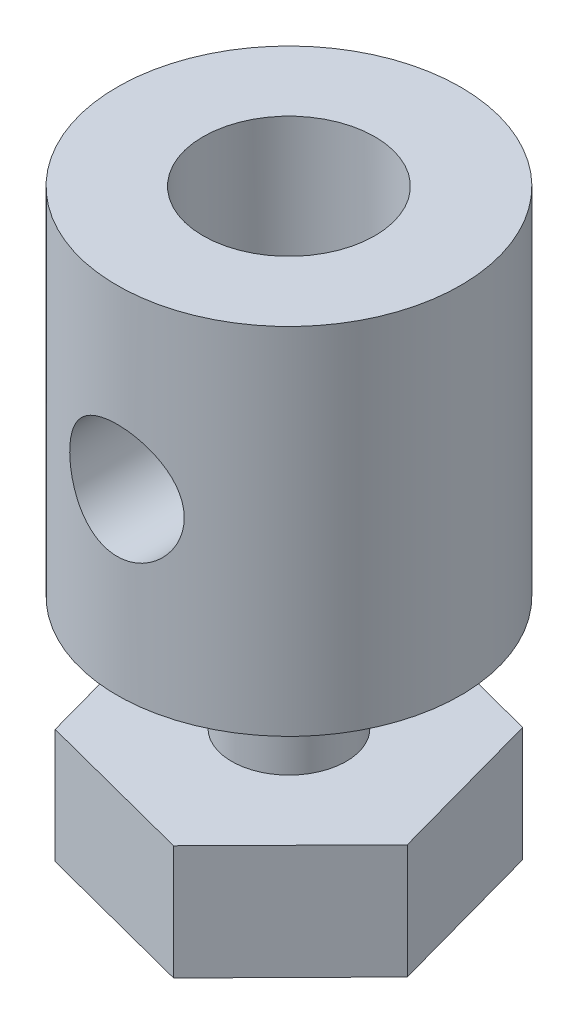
ISO-10303-21;
HEADER;
FILE_DESCRIPTION(('STEP AP214'),'2;1');
FILE_NAME('part.step','',(''),(''),'','','');
FILE_SCHEMA(('AUTOMOTIVE_DESIGN { 1 0 10303 214 1 1 1 1 }'));
ENDSEC;
DATA;
#1=APPLICATION_CONTEXT('core data for automotive mechanical design processes');
#2=APPLICATION_PROTOCOL_DEFINITION('international standard','automotive_design',2000,#1);
#3=PRODUCT_CONTEXT('',#1,'mechanical');
#4=PRODUCT('Part','Part','',(#3));
#5=PRODUCT_RELATED_PRODUCT_CATEGORY('part','',(#4));
#6=PRODUCT_DEFINITION_FORMATION('','',#4);
#7=PRODUCT_DEFINITION_CONTEXT('part definition',#1,'design');
#8=PRODUCT_DEFINITION('design','',#6,#7);
#9=PRODUCT_DEFINITION_SHAPE('','',#8);
#10=(LENGTH_UNIT() NAMED_UNIT(*) SI_UNIT(.MILLI.,.METRE.));
#11=(NAMED_UNIT(*) PLANE_ANGLE_UNIT() SI_UNIT($,.RADIAN.));
#12=(NAMED_UNIT(*) SI_UNIT($,.STERADIAN.) SOLID_ANGLE_UNIT());
#13=UNCERTAINTY_MEASURE_WITH_UNIT(LENGTH_MEASURE(1.E-05),#10,'distance_accuracy_value','');
#14=(GEOMETRIC_REPRESENTATION_CONTEXT(3) GLOBAL_UNCERTAINTY_ASSIGNED_CONTEXT((#13)) GLOBAL_UNIT_ASSIGNED_CONTEXT((#10,
#11,#12)) REPRESENTATION_CONTEXT('',''));
#15=CARTESIAN_POINT('',(0.,0.,0.));
#16=DIRECTION('',(0.,0.,1.));
#17=DIRECTION('',(1.,0.,0.));
#18=AXIS2_PLACEMENT_3D('',#15,#16,#17);
#19=CARTESIAN_POINT('',(0.,0.,0.));
#20=DIRECTION('',(0.,-1.,0.));
#21=DIRECTION('',(0.,0.,-1.));
#22=AXIS2_PLACEMENT_3D('',#19,#20,#21);
#23=CYLINDRICAL_SURFACE('',#22,1.);
#24=CARTESIAN_POINT('',(0.,5.,0.));
#25=DIRECTION('',(0.,-1.,0.));
#26=DIRECTION('',(0.,0.,-1.));
#27=AXIS2_PLACEMENT_3D('',#24,#25,#26);
#28=CIRCLE('',#27,1.);
#29=CARTESIAN_POINT('',(0.,5.,-1.));
#30=VERTEX_POINT('',#29);
#31=EDGE_CURVE('E201',#30,#30,#28,.T.);
#32=ORIENTED_EDGE('',*,*,#31,.T.);
#33=EDGE_LOOP('',(#32));
#34=FACE_BOUND('',#33,.T.);
#35=CARTESIAN_POINT('',(0.,3.,0.));
#36=DIRECTION('',(0.,-1.,0.));
#37=DIRECTION('',(0.,0.,-1.));
#38=AXIS2_PLACEMENT_3D('',#35,#36,#37);
#39=CIRCLE('',#38,1.);
#40=CARTESIAN_POINT('',(0.,3.,-1.));
#41=VERTEX_POINT('',#40);
#42=EDGE_CURVE('E123',#41,#41,#39,.F.);
#43=ORIENTED_EDGE('',*,*,#42,.T.);
#44=EDGE_LOOP('',(#43));
#45=FACE_BOUND('',#44,.T.);
#46=ADVANCED_FACE('F35',(#34,#45),#23,.T.);
#47=CARTESIAN_POINT('',(1.5,7.2,0.));
#48=DIRECTION('',(0.,1.,0.));
#49=DIRECTION('',(0.,0.,1.));
#50=AXIS2_PLACEMENT_3D('',#47,#48,#49);
#51=PLANE('',#50);
#52=DIRECTION('',(0.,0.,1.));
#53=VECTOR('',#52,1.);
#54=CARTESIAN_POINT('',(-0.435889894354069,7.2,-3.));
#55=LINE('',#54,#53);
#56=CARTESIAN_POINT('',(-0.435889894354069,7.2,-1.43527000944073));
#57=VERTEX_POINT('',#56);
#58=CARTESIAN_POINT('',(-0.435889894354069,7.2,1.43527000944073));
#59=VERTEX_POINT('',#58);
#60=EDGE_CURVE('E50',#57,#59,#55,.T.);
#61=ORIENTED_EDGE('',*,*,#60,.F.);
#62=CARTESIAN_POINT('',(0.,7.2,0.));
#63=DIRECTION('',(0.,-1.,0.));
#64=DIRECTION('',(0.,0.,-1.));
#65=AXIS2_PLACEMENT_3D('',#62,#63,#64);
#66=CIRCLE('',#65,1.5);
#67=EDGE_CURVE('E215',#59,#57,#66,.T.);
#68=ORIENTED_EDGE('',*,*,#67,.F.);
#69=EDGE_LOOP('',(#61,#68));
#70=FACE_BOUND('',#69,.T.);
#71=ADVANCED_FACE('F181',(#70),#51,.T.);
#72=DIRECTION('',(0.,0.,1.));
#73=VECTOR('',#72,1.);
#74=CARTESIAN_POINT('',(0.435889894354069,7.2,-3.));
#75=LINE('',#74,#73);
#76=CARTESIAN_POINT('',(0.435889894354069,7.2,1.43527000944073));
#77=VERTEX_POINT('',#76);
#78=CARTESIAN_POINT('',(0.435889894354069,7.2,-1.43527000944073));
#79=VERTEX_POINT('',#78);
#80=EDGE_CURVE('E137',#77,#79,#75,.F.);
#81=ORIENTED_EDGE('',*,*,#80,.F.);
#82=EDGE_CURVE('E216',#79,#77,#66,.T.);
#83=ORIENTED_EDGE('',*,*,#82,.F.);
#84=EDGE_LOOP('',(#81,#83));
#85=FACE_BOUND('',#84,.T.);
#86=ADVANCED_FACE('F176',(#85),#51,.T.);
#87=CARTESIAN_POINT('',(0.,0.,0.));
#88=DIRECTION('',(0.,-1.,0.));
#89=DIRECTION('',(0.,0.,-1.));
#90=AXIS2_PLACEMENT_3D('',#87,#88,#89);
#91=CYLINDRICAL_SURFACE('',#90,1.5);
#92=CARTESIAN_POINT('',(0.435889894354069,7.2,-1.43527000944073));
#93=CARTESIAN_POINT('',(0.489272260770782,7.22588335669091,-1.41910225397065));
#94=CARTESIAN_POINT('',(0.539615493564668,7.25609720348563,-1.40052080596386));
#95=CARTESIAN_POINT('',(0.633604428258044,7.32416361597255,-1.36055779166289));
#96=CARTESIAN_POINT('',(0.677250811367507,7.36201540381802,-1.33917651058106));
#97=CARTESIAN_POINT('',(0.757130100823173,7.44423016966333,-1.29569565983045));
#98=CARTESIAN_POINT('',(0.793382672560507,7.48857532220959,-1.27359818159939));
#99=CARTESIAN_POINT('',(0.858096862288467,7.58332213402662,-1.23092080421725));
#100=CARTESIAN_POINT('',(0.886561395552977,7.63372151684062,-1.2103403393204));
#101=CARTESIAN_POINT('',(0.929523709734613,7.72842573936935,-1.17751983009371));
#102=CARTESIAN_POINT('',(0.945713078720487,7.77166822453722,-1.16443947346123));
#103=CARTESIAN_POINT('',(0.972113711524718,7.86093383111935,-1.14249364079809));
#104=CARTESIAN_POINT('',(0.982336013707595,7.90695164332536,-1.13362038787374));
#105=CARTESIAN_POINT('',(0.996245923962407,8.00113467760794,-1.121421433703));
#106=CARTESIAN_POINT('',(0.99987761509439,8.04931475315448,-1.11814321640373));
#107=CARTESIAN_POINT('',(1.00011619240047,8.14570828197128,-1.11793029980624));
#108=CARTESIAN_POINT('',(0.996723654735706,8.19392173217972,-1.12099508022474));
#109=CARTESIAN_POINT('',(0.984027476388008,8.28294618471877,-1.13214225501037));
#110=CARTESIAN_POINT('',(0.975478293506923,8.32395350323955,-1.13958159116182));
#111=CARTESIAN_POINT('',(0.953616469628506,8.40386597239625,-1.1579373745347));
#112=CARTESIAN_POINT('',(0.94029950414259,8.4427691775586,-1.16885697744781));
#113=CARTESIAN_POINT('',(0.902818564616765,8.53389781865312,-1.19820483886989));
#114=CARTESIAN_POINT('',(0.876448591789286,8.58482219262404,-1.21785758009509));
#115=CARTESIAN_POINT('',(0.815933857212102,8.68093653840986,-1.25920553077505));
#116=CARTESIAN_POINT('',(0.781775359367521,8.72611615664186,-1.28090430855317));
#117=CARTESIAN_POINT('',(0.705779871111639,8.81073833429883,-1.32431733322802));
#118=CARTESIAN_POINT('',(0.663847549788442,8.85009736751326,-1.34602800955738));
#119=CARTESIAN_POINT('',(0.57316299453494,8.92146393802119,-1.38706637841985));
#120=CARTESIAN_POINT('',(0.524420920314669,8.95348224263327,-1.40639754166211));
#121=CARTESIAN_POINT('',(0.429481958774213,9.00440396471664,-1.43792136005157));
#122=CARTESIAN_POINT('',(0.384197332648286,9.02460061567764,-1.45076586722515));
#123=CARTESIAN_POINT('',(0.290268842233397,9.05824175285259,-1.47243364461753));
#124=CARTESIAN_POINT('',(0.241627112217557,9.07169048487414,-1.48125944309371));
#125=CARTESIAN_POINT('',(0.141997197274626,9.09117283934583,-1.49411152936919));
#126=CARTESIAN_POINT('',(0.0909989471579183,9.09717086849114,-1.49811477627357));
#127=CARTESIAN_POINT('',(-0.0114528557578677,9.10124661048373,-1.50083044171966));
#128=CARTESIAN_POINT('',(-0.0629063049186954,9.09932608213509,-1.49954403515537));
#129=CARTESIAN_POINT('',(-0.160390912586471,9.08817354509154,-1.49213683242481));
#130=CARTESIAN_POINT('',(-0.206524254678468,9.0795448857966,-1.48641508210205));
#131=CARTESIAN_POINT('',(-0.296527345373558,9.05615630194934,-1.47110737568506));
#132=CARTESIAN_POINT('',(-0.3403966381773,9.04139514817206,-1.46152064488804));
#133=CARTESIAN_POINT('',(-0.427066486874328,9.00549562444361,-1.43865263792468));
#134=CARTESIAN_POINT('',(-0.469709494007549,8.98408034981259,-1.42521342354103));
#135=CARTESIAN_POINT('',(-0.550898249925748,8.93590797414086,-1.3958430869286));
#136=CARTESIAN_POINT('',(-0.589442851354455,8.90914938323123,-1.37991126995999));
#137=CARTESIAN_POINT('',(-0.667639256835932,8.84641998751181,-1.3440163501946));
#138=CARTESIAN_POINT('',(-0.706550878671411,8.8096654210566,-1.32380999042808));
#139=CARTESIAN_POINT('',(-0.778053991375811,8.73046457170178,-1.28309399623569));
#140=CARTESIAN_POINT('',(-0.810632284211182,8.68800670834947,-1.26258382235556));
#141=CARTESIAN_POINT('',(-0.872509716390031,8.59230704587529,-1.22077085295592));
#142=CARTESIAN_POINT('',(-0.900909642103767,8.53838108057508,-1.19968199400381));
#143=CARTESIAN_POINT('',(-0.947790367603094,8.42471032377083,-1.16300888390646));
#144=CARTESIAN_POINT('',(-0.966307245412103,8.3649876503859,-1.14740468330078));
#145=CARTESIAN_POINT('',(-0.987726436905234,8.26183564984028,-1.12894852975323));
#146=CARTESIAN_POINT('',(-0.993760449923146,8.21950218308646,-1.1235909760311));
#147=CARTESIAN_POINT('',(-1.00033288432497,8.13409399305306,-1.11774607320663));
#148=CARTESIAN_POINT('',(-1.00087713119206,8.0910201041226,-1.11725356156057));
#149=CARTESIAN_POINT('',(-0.996440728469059,8.00543586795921,-1.1212105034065));
#150=CARTESIAN_POINT('',(-0.991464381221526,7.96292510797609,-1.12565610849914));
#151=CARTESIAN_POINT('',(-0.976312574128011,7.8795083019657,-1.13882039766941));
#152=CARTESIAN_POINT('',(-0.96613022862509,7.83860445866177,-1.14754474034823));
#153=CARTESIAN_POINT('',(-0.937065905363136,7.74656309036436,-1.17147863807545));
#154=CARTESIAN_POINT('',(-0.916450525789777,7.69628373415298,-1.18786680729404));
#155=CARTESIAN_POINT('',(-0.867986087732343,7.60050753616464,-1.22372726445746));
#156=CARTESIAN_POINT('',(-0.840122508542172,7.55502055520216,-1.24320571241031));
#157=CARTESIAN_POINT('',(-0.777231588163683,7.46847329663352,-1.28348506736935));
#158=CARTESIAN_POINT('',(-0.742078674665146,7.42751306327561,-1.30430402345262));
#159=CARTESIAN_POINT('',(-0.665452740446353,7.35162263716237,-1.34500821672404));
#160=CARTESIAN_POINT('',(-0.623995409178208,7.31667792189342,-1.36489561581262));
#161=CARTESIAN_POINT('',(-0.557120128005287,7.26910864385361,-1.39291586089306));
#162=CARTESIAN_POINT('',(-0.533861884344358,7.25396910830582,-1.40201294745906));
#163=CARTESIAN_POINT('',(-0.485922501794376,7.22555426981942,-1.41934130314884));
#164=CARTESIAN_POINT('',(-0.461241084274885,7.21227933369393,-1.42757240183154));
#165=CARTESIAN_POINT('',(-0.43588989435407,7.2,-1.43527000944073));
#166=B_SPLINE_CURVE_WITH_KNOTS('',3,(#92,#93,#94,#95,#96,#97,#98,#99,#100,#101,#102,#103,#104,
#105,#106,#107,#108,#109,#110,#111,#112,#113,#114,#115,#116,#117,#118,#119,#120,#121,#122,#123,
#124,#125,#126,#127,#128,#129,#130,#131,#132,#133,#134,#135,#136,#137,#138,#139,#140,#141,#142,
#143,#144,#145,#146,#147,#148,#149,#150,#151,#152,#153,#154,#155,#156,#157,#158,#159,#160,#161,
#162,#163,#164,#165),.UNSPECIFIED.,.F.,.F.,(4,2,2,2,2,2,2,2,2,2,2,2,2,2,2,2,2,2,2,2,2,2,2,2,2,2,
2,2,2,2,2,2,2,2,2,2,4),(0.,0.18394734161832,0.367875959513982,0.551308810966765,
0.734672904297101,0.878112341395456,1.0212855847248,1.16566797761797,1.31003852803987,
1.43716464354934,1.56440635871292,1.7453114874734,1.92653816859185,2.11015507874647,
2.29350091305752,2.44652417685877,2.59945103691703,2.75310568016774,2.90672619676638,
3.04793330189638,3.18916872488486,3.33732074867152,3.48551413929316,3.65648200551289,
3.82780242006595,4.02024073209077,4.21197165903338,4.34069043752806,4.46927261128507,
4.59775464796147,4.72640706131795,4.89577549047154,5.06548587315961,5.23840740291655,
5.41090542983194,5.49842476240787,5.58596128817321),.UNSPECIFIED.);
#167=EDGE_CURVE('E55',#79,#57,#166,.T.);
#168=ORIENTED_EDGE('',*,*,#167,.F.);
#169=ORIENTED_EDGE('',*,*,#82,.T.);
#170=CARTESIAN_POINT('',(-0.435889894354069,7.2,1.43527000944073));
#171=CARTESIAN_POINT('',(-0.489272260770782,7.22588335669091,1.41910225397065));
#172=CARTESIAN_POINT('',(-0.539615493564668,7.25609720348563,1.40052080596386));
#173=CARTESIAN_POINT('',(-0.633604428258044,7.32416361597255,1.36055779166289));
#174=CARTESIAN_POINT('',(-0.677250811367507,7.36201540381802,1.33917651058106));
#175=CARTESIAN_POINT('',(-0.757130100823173,7.44423016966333,1.29569565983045));
#176=CARTESIAN_POINT('',(-0.793382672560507,7.48857532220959,1.27359818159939));
#177=CARTESIAN_POINT('',(-0.858096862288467,7.58332213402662,1.23092080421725));
#178=CARTESIAN_POINT('',(-0.886561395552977,7.63372151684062,1.2103403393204));
#179=CARTESIAN_POINT('',(-0.929523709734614,7.72842573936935,1.17751983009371));
#180=CARTESIAN_POINT('',(-0.945713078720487,7.77166822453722,1.16443947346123));
#181=CARTESIAN_POINT('',(-0.972113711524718,7.86093383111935,1.14249364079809));
#182=CARTESIAN_POINT('',(-0.982336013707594,7.90695164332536,1.13362038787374));
#183=CARTESIAN_POINT('',(-0.996245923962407,8.00113467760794,1.121421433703));
#184=CARTESIAN_POINT('',(-0.99987761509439,8.04931475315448,1.11814321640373));
#185=CARTESIAN_POINT('',(-1.00011619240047,8.14570828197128,1.11793029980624));
#186=CARTESIAN_POINT('',(-0.996723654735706,8.19392173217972,1.12099508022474));
#187=CARTESIAN_POINT('',(-0.984027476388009,8.28294618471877,1.13214225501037));
#188=CARTESIAN_POINT('',(-0.975478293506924,8.32395350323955,1.13958159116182));
#189=CARTESIAN_POINT('',(-0.953616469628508,8.40386597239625,1.15793737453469));
#190=CARTESIAN_POINT('',(-0.940299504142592,8.44276917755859,1.16885697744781));
#191=CARTESIAN_POINT('',(-0.902818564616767,8.53389781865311,1.19820483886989));
#192=CARTESIAN_POINT('',(-0.876448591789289,8.58482219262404,1.21785758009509));
#193=CARTESIAN_POINT('',(-0.815933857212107,8.68093653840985,1.25920553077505));
#194=CARTESIAN_POINT('',(-0.781775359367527,8.72611615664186,1.28090430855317));
#195=CARTESIAN_POINT('',(-0.705779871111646,8.81073833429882,1.32431733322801));
#196=CARTESIAN_POINT('',(-0.663847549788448,8.85009736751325,1.34602800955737));
#197=CARTESIAN_POINT('',(-0.573162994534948,8.92146393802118,1.38706637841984));
#198=CARTESIAN_POINT('',(-0.524420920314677,8.95348224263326,1.40639754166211));
#199=CARTESIAN_POINT('',(-0.429481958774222,9.00440396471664,1.43792136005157));
#200=CARTESIAN_POINT('',(-0.384197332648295,9.02460061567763,1.45076586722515));
#201=CARTESIAN_POINT('',(-0.290268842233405,9.05824175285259,1.47243364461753));
#202=CARTESIAN_POINT('',(-0.241627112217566,9.07169048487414,1.48125944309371));
#203=CARTESIAN_POINT('',(-0.141997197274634,9.09117283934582,1.49411152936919));
#204=CARTESIAN_POINT('',(-0.0909989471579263,9.09717086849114,1.49811477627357));
#205=CARTESIAN_POINT('',(0.0114528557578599,9.10124661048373,1.50083044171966));
#206=CARTESIAN_POINT('',(0.0629063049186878,9.0993260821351,1.49954403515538));
#207=CARTESIAN_POINT('',(0.160390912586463,9.08817354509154,1.49213683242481));
#208=CARTESIAN_POINT('',(0.206524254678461,9.0795448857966,1.48641508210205));
#209=CARTESIAN_POINT('',(0.296527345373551,9.05615630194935,1.47110737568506));
#210=CARTESIAN_POINT('',(0.340396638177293,9.04139514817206,1.46152064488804));
#211=CARTESIAN_POINT('',(0.427066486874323,9.00549562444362,1.43865263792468));
#212=CARTESIAN_POINT('',(0.469709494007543,8.9840803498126,1.42521342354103));
#213=CARTESIAN_POINT('',(0.550898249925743,8.93590797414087,1.3958430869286));
#214=CARTESIAN_POINT('',(0.58944285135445,8.90914938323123,1.37991126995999));
#215=CARTESIAN_POINT('',(0.667639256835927,8.84641998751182,1.3440163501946));
#216=CARTESIAN_POINT('',(0.706550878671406,8.8096654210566,1.32380999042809));
#217=CARTESIAN_POINT('',(0.778053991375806,8.73046457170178,1.28309399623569));
#218=CARTESIAN_POINT('',(0.810632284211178,8.68800670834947,1.26258382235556));
#219=CARTESIAN_POINT('',(0.872509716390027,8.59230704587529,1.22077085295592));
#220=CARTESIAN_POINT('',(0.900909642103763,8.53838108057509,1.19968199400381));
#221=CARTESIAN_POINT('',(0.947790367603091,8.42471032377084,1.16300888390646));
#222=CARTESIAN_POINT('',(0.9663072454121,8.3649876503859,1.14740468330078));
#223=CARTESIAN_POINT('',(0.987726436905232,8.26183564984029,1.12894852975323));
#224=CARTESIAN_POINT('',(0.993760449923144,8.21950218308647,1.1235909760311));
#225=CARTESIAN_POINT('',(1.00033288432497,8.13409399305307,1.11774607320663));
#226=CARTESIAN_POINT('',(1.00087713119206,8.09102010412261,1.11725356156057));
#227=CARTESIAN_POINT('',(0.99644072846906,8.00543586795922,1.1212105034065));
#228=CARTESIAN_POINT('',(0.991464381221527,7.96292510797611,1.12565610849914));
#229=CARTESIAN_POINT('',(0.976312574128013,7.87950830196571,1.13882039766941));
#230=CARTESIAN_POINT('',(0.966130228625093,7.83860445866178,1.14754474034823));
#231=CARTESIAN_POINT('',(0.93706590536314,7.74656309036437,1.17147863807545));
#232=CARTESIAN_POINT('',(0.916450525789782,7.69628373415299,1.18786680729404));
#233=CARTESIAN_POINT('',(0.867986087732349,7.60050753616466,1.22372726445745));
#234=CARTESIAN_POINT('',(0.840122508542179,7.55502055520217,1.2432057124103));
#235=CARTESIAN_POINT('',(0.777231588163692,7.46847329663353,1.28348506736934));
#236=CARTESIAN_POINT('',(0.742078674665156,7.42751306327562,1.30430402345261));
#237=CARTESIAN_POINT('',(0.665452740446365,7.35162263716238,1.34500821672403));
#238=CARTESIAN_POINT('',(0.623995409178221,7.31667792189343,1.36489561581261));
#239=CARTESIAN_POINT('',(0.557120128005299,7.26910864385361,1.39291586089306));
#240=CARTESIAN_POINT('',(0.533861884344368,7.25396910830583,1.40201294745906));
#241=CARTESIAN_POINT('',(0.485922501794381,7.22555426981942,1.41934130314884));
#242=CARTESIAN_POINT('',(0.461241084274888,7.21227933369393,1.42757240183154));
#243=CARTESIAN_POINT('',(0.43588989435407,7.2,1.43527000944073));
#244=B_SPLINE_CURVE_WITH_KNOTS('',3,(#170,#171,#172,#173,#174,#175,#176,#177,#178,#179,#180,
#181,#182,#183,#184,#185,#186,#187,#188,#189,#190,#191,#192,#193,#194,#195,#196,#197,#198,#199,
#200,#201,#202,#203,#204,#205,#206,#207,#208,#209,#210,#211,#212,#213,#214,#215,#216,#217,#218,
#219,#220,#221,#222,#223,#224,#225,#226,#227,#228,#229,#230,#231,#232,#233,#234,#235,#236,#237,
#238,#239,#240,#241,#242,#243),.UNSPECIFIED.,.F.,.F.,(4,2,2,2,2,2,2,2,2,2,2,2,2,2,2,2,2,2,2,2,2,
2,2,2,2,2,2,2,2,2,2,2,2,2,2,2,4),(0.,0.18394734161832,0.367875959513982,0.551308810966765,
0.734672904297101,0.878112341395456,1.0212855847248,1.16566797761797,1.31003852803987,
1.43716464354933,1.56440635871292,1.74531148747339,1.92653816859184,2.11015507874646,
2.29350091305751,2.44652417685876,2.59945103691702,2.75310568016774,2.90672619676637,
3.04793330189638,3.18916872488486,3.33732074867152,3.48551413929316,3.65648200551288,
3.82780242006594,4.02024073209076,4.21197165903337,4.34069043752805,4.46927261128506,
4.59775464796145,4.72640706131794,4.89577549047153,5.0654858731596,5.23840740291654,
5.41090542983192,5.49842476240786,5.58596128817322),.UNSPECIFIED.);
#245=EDGE_CURVE('E126',#59,#77,#244,.T.);
#246=ORIENTED_EDGE('',*,*,#245,.F.);
#247=ORIENTED_EDGE('',*,*,#67,.T.);
#248=EDGE_LOOP('',(#168,#169,#246,#247));
#249=FACE_BOUND('',#248,.T.);
#250=CARTESIAN_POINT('',(0.,11.2,0.));
#251=DIRECTION('',(0.,-1.,0.));
#252=DIRECTION('',(0.,0.,-1.));
#253=AXIS2_PLACEMENT_3D('',#250,#251,#252);
#254=CIRCLE('',#253,1.5);
#255=CARTESIAN_POINT('',(0.,11.2,-1.5));
#256=VERTEX_POINT('',#255);
#257=EDGE_CURVE('E214',#256,#256,#254,.T.);
#258=ORIENTED_EDGE('',*,*,#257,.F.);
#259=EDGE_LOOP('',(#258));
#260=FACE_BOUND('',#259,.T.);
#261=ADVANCED_FACE('F139',(#249,#260),#91,.F.);
#262=CARTESIAN_POINT('',(1.5,11.2,0.));
#263=DIRECTION('',(0.,1.,0.));
#264=DIRECTION('',(0.,0.,1.));
#265=AXIS2_PLACEMENT_3D('',#262,#263,#264);
#266=PLANE('',#265);
#267=ORIENTED_EDGE('',*,*,#257,.T.);
#268=EDGE_LOOP('',(#267));
#269=FACE_BOUND('',#268,.T.);
#270=CARTESIAN_POINT('',(0.,11.2,0.));
#271=DIRECTION('',(0.,-1.,0.));
#272=DIRECTION('',(0.,0.,-1.));
#273=AXIS2_PLACEMENT_3D('',#270,#271,#272);
#274=CIRCLE('',#273,3.);
#275=CARTESIAN_POINT('',(0.,11.2,-3.));
#276=VERTEX_POINT('',#275);
#277=EDGE_CURVE('E211',#276,#276,#274,.T.);
#278=ORIENTED_EDGE('',*,*,#277,.F.);
#279=EDGE_LOOP('',(#278));
#280=FACE_BOUND('',#279,.T.);
#281=ADVANCED_FACE('F168',(#269,#280),#266,.T.);
#282=CARTESIAN_POINT('',(0.,0.,0.));
#283=DIRECTION('',(0.,-1.,0.));
#284=DIRECTION('',(0.,0.,-1.));
#285=AXIS2_PLACEMENT_3D('',#282,#283,#284);
#286=CYLINDRICAL_SURFACE('',#285,3.);
#287=CARTESIAN_POINT('',(0.,9.1,-3.));
#288=CARTESIAN_POINT('',(0.0545633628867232,9.10000025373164,-3.00000015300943));
#289=CARTESIAN_POINT('',(0.10912519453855,9.09551973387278,-2.99849769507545));
#290=CARTESIAN_POINT('',(0.216641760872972,9.07777089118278,-2.99265210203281));
#291=CARTESIAN_POINT('',(0.269596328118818,9.06450165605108,-2.98830867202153));
#292=CARTESIAN_POINT('',(0.372332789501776,9.02968075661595,-2.97725307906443));
#293=CARTESIAN_POINT('',(0.422119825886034,9.00814293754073,-2.97054487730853));
#294=CARTESIAN_POINT('',(0.517374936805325,8.95745882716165,-2.95544445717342));
#295=CARTESIAN_POINT('',(0.562842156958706,8.9283110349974,-2.94705190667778));
#296=CARTESIAN_POINT('',(0.649741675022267,8.86217419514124,-2.92914094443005));
#297=CARTESIAN_POINT('',(0.691003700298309,8.82496876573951,-2.91959556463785));
#298=CARTESIAN_POINT('',(0.766832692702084,8.74423284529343,-2.90060314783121));
#299=CARTESIAN_POINT('',(0.801398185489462,8.70070096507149,-2.89115613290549));
#300=CARTESIAN_POINT('',(0.863824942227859,8.60701488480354,-2.87313332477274));
#301=CARTESIAN_POINT('',(0.891464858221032,8.55670626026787,-2.86459039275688));
#302=CARTESIAN_POINT('',(0.937818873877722,8.45182390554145,-2.84975305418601));
#303=CARTESIAN_POINT('',(0.956535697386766,8.39725148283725,-2.84345796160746));
#304=CARTESIAN_POINT('',(0.983873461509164,8.28732677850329,-2.83411303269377));
#305=CARTESIAN_POINT('',(0.99281344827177,8.23206279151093,-2.83096095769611));
#306=CARTESIAN_POINT('',(1.00134112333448,8.12073624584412,-2.82795656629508));
#307=CARTESIAN_POINT('',(1.00093170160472,8.06467393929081,-2.8281032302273));
#308=CARTESIAN_POINT('',(0.99101990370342,7.95606336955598,-2.8315901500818));
#309=CARTESIAN_POINT('',(0.981933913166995,7.90347159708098,-2.83478415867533));
#310=CARTESIAN_POINT('',(0.955606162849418,7.80060658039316,-2.84376657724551));
#311=CARTESIAN_POINT('',(0.938363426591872,7.75033361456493,-2.84955529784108));
#312=CARTESIAN_POINT('',(0.895939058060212,7.65258725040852,-2.86317911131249));
#313=CARTESIAN_POINT('',(0.870634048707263,7.60517197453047,-2.87104565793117));
#314=CARTESIAN_POINT('',(0.81288910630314,7.51512909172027,-2.88792558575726));
#315=CARTESIAN_POINT('',(0.780447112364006,7.47250287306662,-2.89693929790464));
#316=CARTESIAN_POINT('',(0.707349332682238,7.39090840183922,-2.91567329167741));
#317=CARTESIAN_POINT('',(0.666353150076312,7.35224730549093,-2.92540589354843));
#318=CARTESIAN_POINT('',(0.578339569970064,7.2822687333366,-2.94406938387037));
#319=CARTESIAN_POINT('',(0.531321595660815,7.2509519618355,-2.95300019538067));
#320=CARTESIAN_POINT('',(0.431947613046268,7.19630369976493,-2.96917107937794));
#321=CARTESIAN_POINT('',(0.379543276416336,7.17305450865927,-2.97639350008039));
#322=CARTESIAN_POINT('',(0.271269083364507,7.13579682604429,-2.98820567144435));
#323=CARTESIAN_POINT('',(0.215400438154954,7.12178512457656,-2.99279633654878));
#324=CARTESIAN_POINT('',(0.104383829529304,7.10394433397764,-2.99867627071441));
#325=CARTESIAN_POINT('',(0.0493095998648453,7.09970019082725,-3.00010001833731));
#326=CARTESIAN_POINT('',(-0.0607750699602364,7.10033267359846,-2.99988902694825));
#327=CARTESIAN_POINT('',(-0.115785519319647,7.10520775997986,-2.99825480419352));
#328=CARTESIAN_POINT('',(-0.222519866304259,7.12361190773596,-2.99220024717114));
#329=CARTESIAN_POINT('',(-0.274292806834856,7.13688620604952,-2.98786198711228));
#330=CARTESIAN_POINT('',(-0.374855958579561,7.1713934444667,-2.97691846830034));
#331=CARTESIAN_POINT('',(-0.42364578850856,7.19262739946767,-2.97031292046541));
#332=CARTESIAN_POINT('',(-0.518288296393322,7.2430704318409,-2.95528931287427));
#333=CARTESIAN_POINT('',(-0.56402995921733,7.2724745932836,-2.94682814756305));
#334=CARTESIAN_POINT('',(-0.650064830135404,7.33819415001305,-2.92905253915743));
#335=CARTESIAN_POINT('',(-0.690356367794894,7.37451165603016,-2.91973783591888));
#336=CARTESIAN_POINT('',(-0.766252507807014,7.45497875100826,-2.90076847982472));
#337=CARTESIAN_POINT('',(-0.801560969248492,7.49940922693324,-2.89111761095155));
#338=CARTESIAN_POINT('',(-0.864257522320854,7.5937715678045,-2.87299973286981));
#339=CARTESIAN_POINT('',(-0.891645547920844,7.6437034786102,-2.8645327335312));
#340=CARTESIAN_POINT('',(-0.937596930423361,7.74767301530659,-2.84982391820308));
#341=CARTESIAN_POINT('',(-0.956178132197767,7.80170207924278,-2.84357760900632));
#342=CARTESIAN_POINT('',(-0.983894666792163,7.91237865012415,-2.83410832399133));
#343=CARTESIAN_POINT('',(-0.993034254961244,7.96902496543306,-2.83088398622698));
#344=CARTESIAN_POINT('',(-1.00127628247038,8.08019709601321,-2.82797858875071));
#345=CARTESIAN_POINT('',(-1.00087025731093,8.13468234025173,-2.82812400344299));
#346=CARTESIAN_POINT('',(-0.991242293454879,8.24276507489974,-2.8315126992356));
#347=CARTESIAN_POINT('',(-0.982020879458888,8.29636261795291,-2.83475579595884));
#348=CARTESIAN_POINT('',(-0.955371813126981,8.40013566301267,-2.84384524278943));
#349=CARTESIAN_POINT('',(-0.93810334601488,8.45035682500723,-2.84964098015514));
#350=CARTESIAN_POINT('',(-0.895979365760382,8.54722740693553,-2.86316398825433));
#351=CARTESIAN_POINT('',(-0.87112216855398,8.59387603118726,-2.87089168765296));
#352=CARTESIAN_POINT('',(-0.81326069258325,8.68448366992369,-2.8878282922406));
#353=CARTESIAN_POINT('',(-0.779948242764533,8.72823650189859,-2.89708711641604));
#354=CARTESIAN_POINT('',(-0.706642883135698,8.80968981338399,-2.91583356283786));
#355=CARTESIAN_POINT('',(-0.666648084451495,8.84738857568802,-2.92532124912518));
#356=CARTESIAN_POINT('',(-0.579241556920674,8.91714441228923,-2.94390030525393));
#357=CARTESIAN_POINT('',(-0.531601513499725,8.94892434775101,-2.95296181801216));
#358=CARTESIAN_POINT('',(-0.431357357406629,9.00399042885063,-2.96925991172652));
#359=CARTESIAN_POINT('',(-0.37875451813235,9.02727874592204,-2.9764969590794));
#360=CARTESIAN_POINT('',(-0.272493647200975,9.06372163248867,-2.98805515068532));
#361=CARTESIAN_POINT('',(-0.218987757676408,9.07728246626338,-2.9924921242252));
#362=CARTESIAN_POINT('',(-0.110320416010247,9.09542028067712,-2.99846407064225));
#363=CARTESIAN_POINT('',(-0.0551594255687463,9.09999974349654,-2.99999984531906));
#364=CARTESIAN_POINT('',(0.,9.1,-3.));
#365=B_SPLINE_CURVE_WITH_KNOTS('',3,(#287,#288,#289,#290,#291,#292,#293,#294,#295,#296,#297,
#298,#299,#300,#301,#302,#303,#304,#305,#306,#307,#308,#309,#310,#311,#312,#313,#314,#315,#316,
#317,#318,#319,#320,#321,#322,#323,#324,#325,#326,#327,#328,#329,#330,#331,#332,#333,#334,#335,
#336,#337,#338,#339,#340,#341,#342,#343,#344,#345,#346,#347,#348,#349,#350,#351,#352,#353,#354,
#355,#356,#357,#358,#359,#360,#361,#362,#363,#364),.UNSPECIFIED.,.T.,.F.,(4,2,2,2,2,2,2,2,2,2,2,
2,2,2,2,2,2,2,2,2,2,2,2,2,2,2,2,2,2,2,2,2,2,2,2,2,2,2,4),(0.,0.163487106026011,
0.326991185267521,0.490222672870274,0.653486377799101,0.821846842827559,0.990244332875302,
1.16348384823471,1.33667044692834,1.5040192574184,1.67131633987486,1.8309682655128,
1.99063930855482,2.15288171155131,2.31517102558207,2.48593305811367,2.65671145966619,
2.82918405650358,3.00159668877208,3.1665358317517,3.33144713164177,3.49158157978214,
3.65173645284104,3.81610399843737,3.98052180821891,4.15241022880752,4.32430008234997,
4.49584013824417,4.66730284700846,4.82995666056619,4.99260079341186,5.15215587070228,
5.31174638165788,5.47830066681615,5.64490211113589,5.81799660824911,5.99104681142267,
6.15636558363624,6.3216386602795),.UNSPECIFIED.);
#366=CARTESIAN_POINT('',(0.,9.1,-3.));
#367=VERTEX_POINT('',#366);
#368=EDGE_CURVE('E43',#367,#367,#365,.T.);
#369=ORIENTED_EDGE('',*,*,#368,.F.);
#370=EDGE_LOOP('',(#369));
#371=FACE_BOUND('',#370,.T.);
#372=CARTESIAN_POINT('',(1.,8.1,2.82842712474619));
#373=CARTESIAN_POINT('',(1.0000002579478,8.15446817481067,2.82842694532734));
#374=CARTESIAN_POINT('',(0.995534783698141,8.20893479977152,2.83001769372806));
#375=CARTESIAN_POINT('',(0.977851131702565,8.31625442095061,2.8361757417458));
#376=CARTESIAN_POINT('',(0.964631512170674,8.36910714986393,2.8407435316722));
#377=CARTESIAN_POINT('',(0.929955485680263,8.47162689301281,2.85228203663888));
#378=CARTESIAN_POINT('',(0.908515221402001,8.52129992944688,2.8592480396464));
#379=CARTESIAN_POINT('',(0.858061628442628,8.61636004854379,2.87479122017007));
#380=CARTESIAN_POINT('',(0.829046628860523,8.66174618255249,2.88336875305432));
#381=CARTESIAN_POINT('',(0.763051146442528,8.74871996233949,2.90154489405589));
#382=CARTESIAN_POINT('',(0.725824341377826,8.79011542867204,2.91116894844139));
#383=CARTESIAN_POINT('',(0.644987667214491,8.86620680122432,2.93013864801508));
#384=CARTESIAN_POINT('',(0.601376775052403,8.90090163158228,2.93948424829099));
#385=CARTESIAN_POINT('',(0.507604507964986,8.96347889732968,2.95713866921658));
#386=CARTESIAN_POINT('',(0.45730191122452,8.99115997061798,2.96541407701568));
#387=CARTESIAN_POINT('',(0.352431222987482,9.03759158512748,2.9796958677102));
#388=CARTESIAN_POINT('',(0.297864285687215,9.0563445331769,2.98570286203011));
#389=CARTESIAN_POINT('',(0.188028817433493,9.0837358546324,2.99459075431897));
#390=CARTESIAN_POINT('',(0.132850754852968,9.092703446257,2.99757314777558));
#391=CARTESIAN_POINT('',(0.0216978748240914,9.10131629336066,3.00043608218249));
#392=CARTESIAN_POINT('',(-0.0342767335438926,9.10096395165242,3.00031742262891));
#393=CARTESIAN_POINT('',(-0.143103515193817,9.09115574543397,2.99706039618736));
#394=CARTESIAN_POINT('',(-0.195992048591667,9.08205747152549,2.99404064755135));
#395=CARTESIAN_POINT('',(-0.299443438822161,9.05560701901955,2.98546967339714));
#396=CARTESIAN_POINT('',(-0.350006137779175,9.03825428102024,2.97991827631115));
#397=CARTESIAN_POINT('',(-0.448152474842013,8.99557868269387,2.96675670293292));
#398=CARTESIAN_POINT('',(-0.495688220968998,8.97015406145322,2.9591204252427));
#399=CARTESIAN_POINT('',(-0.585924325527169,8.91214029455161,2.94258393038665));
#400=CARTESIAN_POINT('',(-0.628623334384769,8.87954915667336,2.93368336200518));
#401=CARTESIAN_POINT('',(-0.710100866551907,8.80632560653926,2.9150619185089));
#402=CARTESIAN_POINT('',(-0.748600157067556,8.76538684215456,2.90532215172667));
#403=CARTESIAN_POINT('',(-0.81827725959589,8.67755127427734,2.88647335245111));
#404=CARTESIAN_POINT('',(-0.849453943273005,8.63065355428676,2.8773644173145));
#405=CARTESIAN_POINT('',(-0.903987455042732,8.53134637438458,2.86070525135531));
#406=CARTESIAN_POINT('',(-0.927226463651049,8.47886786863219,2.85317909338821));
#407=CARTESIAN_POINT('',(-0.964443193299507,8.37042860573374,2.84081650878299));
#408=CARTESIAN_POINT('',(-0.97842479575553,8.31446931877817,2.83597895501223));
#409=CARTESIAN_POINT('',(-0.996161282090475,8.20336164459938,2.8297963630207));
#410=CARTESIAN_POINT('',(-1.00034909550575,8.14829057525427,2.82830360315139));
#411=CARTESIAN_POINT('',(-0.999605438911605,8.03822385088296,2.828566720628));
#412=CARTESIAN_POINT('',(-0.994675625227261,7.98322818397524,2.83032200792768));
#413=CARTESIAN_POINT('',(-0.976225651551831,7.87684303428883,2.83673618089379));
#414=CARTESIAN_POINT('',(-0.963006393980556,7.82539456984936,2.84129325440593));
#415=CARTESIAN_POINT('',(-0.928713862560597,7.72545639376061,2.8526855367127));
#416=CARTESIAN_POINT('',(-0.907639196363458,7.67696720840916,2.85952114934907));
#417=CARTESIAN_POINT('',(-0.857474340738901,7.58261957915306,2.87496877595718));
#418=CARTESIAN_POINT('',(-0.828151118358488,7.53689335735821,2.8836302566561));
#419=CARTESIAN_POINT('',(-0.762585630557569,7.45085394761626,2.90165768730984));
#420=CARTESIAN_POINT('',(-0.726341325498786,7.41054236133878,2.91102384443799));
#421=CARTESIAN_POINT('',(-0.645891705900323,7.33447201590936,2.92995038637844));
#422=CARTESIAN_POINT('',(-0.601387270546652,7.29902560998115,2.93949843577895));
#423=CARTESIAN_POINT('',(-0.506827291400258,7.23608385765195,2.9572685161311));
#424=CARTESIAN_POINT('',(-0.456771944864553,7.20858822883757,2.96549059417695));
#425=CARTESIAN_POINT('',(-0.352779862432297,7.16257989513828,2.97964405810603));
#426=CARTESIAN_POINT('',(-0.298871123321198,7.14400872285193,2.98559030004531));
#427=CARTESIAN_POINT('',(-0.188458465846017,7.11627225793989,2.99458610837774));
#428=CARTESIAN_POINT('',(-0.131955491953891,7.10710357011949,2.99763672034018));
#429=CARTESIAN_POINT('',(-0.0208153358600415,7.09873792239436,3.00041863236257));
#430=CARTESIAN_POINT('',(0.0337847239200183,7.09909254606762,3.00029920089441));
#431=CARTESIAN_POINT('',(0.142111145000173,7.10865730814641,2.99712196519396));
#432=CARTESIAN_POINT('',(0.195837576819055,7.11786672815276,2.99406439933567));
#433=CARTESIAN_POINT('',(0.30004211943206,7.14458223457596,2.98540914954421));
#434=CARTESIAN_POINT('',(0.350558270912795,7.16195421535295,2.9798525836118));
#435=CARTESIAN_POINT('',(0.447978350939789,7.20437753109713,2.96677160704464));
#436=CARTESIAN_POINT('',(0.494881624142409,7.22943025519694,2.95924684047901));
#437=CARTESIAN_POINT('',(0.585634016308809,7.28756951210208,2.94265868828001));
#438=CARTESIAN_POINT('',(0.629306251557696,7.32091868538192,2.93354872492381));
#439=CARTESIAN_POINT('',(0.710581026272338,7.39425739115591,2.91492988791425));
#440=CARTESIAN_POINT('',(0.748181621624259,7.43424904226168,2.90542088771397));
#441=CARTESIAN_POINT('',(0.817741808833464,7.52160935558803,2.88663279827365));
#442=CARTESIAN_POINT('',(0.849422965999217,7.56920551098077,2.87737727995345));
#443=CARTESIAN_POINT('',(0.9043143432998,7.66933442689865,2.86060193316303));
#444=CARTESIAN_POINT('',(0.927526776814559,7.72186589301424,2.8530816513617));
#445=CARTESIAN_POINT('',(0.963843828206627,7.82796182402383,2.84101334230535));
#446=CARTESIAN_POINT('',(0.977357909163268,7.88137226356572,2.83634632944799));
#447=CARTESIAN_POINT('',(0.995434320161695,7.98985605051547,2.83005383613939));
#448=CARTESIAN_POINT('',(0.999999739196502,8.04492881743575,2.82842730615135));
#449=CARTESIAN_POINT('',(1.,8.1,2.82842712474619));
#450=B_SPLINE_CURVE_WITH_KNOTS('',3,(#372,#373,#374,#375,#376,#377,#378,#379,#380,#381,#382,
#383,#384,#385,#386,#387,#388,#389,#390,#391,#392,#393,#394,#395,#396,#397,#398,#399,#400,#401,
#402,#403,#404,#405,#406,#407,#408,#409,#410,#411,#412,#413,#414,#415,#416,#417,#418,#419,#420,
#421,#422,#423,#424,#425,#426,#427,#428,#429,#430,#431,#432,#433,#434,#435,#436,#437,#438,#439,
#440,#441,#442,#443,#444,#445,#446,#447,#448,#449),.UNSPECIFIED.,.T.,.F.,(4,2,2,2,2,2,2,2,2,2,2,
2,2,2,2,2,2,2,2,2,2,2,2,2,2,2,2,2,2,2,2,2,2,2,2,2,2,2,4),(0.,0.163200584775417,0.32642805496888,
0.489336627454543,0.652281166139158,0.821013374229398,0.989772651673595,1.16293506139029,
1.33605076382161,1.50314318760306,1.67019253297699,1.83069004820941,1.99119844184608,
2.15381654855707,2.31647991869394,2.48680174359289,2.65714979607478,2.82992639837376,
3.00263051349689,3.16754291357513,3.33242535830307,3.49164395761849,3.65089079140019,
3.81518857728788,3.979534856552,4.15178808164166,4.32403518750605,4.49513791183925,
4.6661788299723,4.82918084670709,4.99216964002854,5.15256956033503,5.31299850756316,
5.47935519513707,5.64576504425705,5.81868902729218,5.9915677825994,6.15663212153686,
6.3216394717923),.UNSPECIFIED.);
#451=CARTESIAN_POINT('',(1.,8.1,2.82842712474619));
#452=VERTEX_POINT('',#451);
#453=EDGE_CURVE('E154',#452,#452,#450,.T.);
#454=ORIENTED_EDGE('',*,*,#453,.F.);
#455=EDGE_LOOP('',(#454));
#456=FACE_BOUND('',#455,.T.);
#457=ORIENTED_EDGE('',*,*,#277,.T.);
#458=EDGE_LOOP('',(#457));
#459=FACE_BOUND('',#458,.T.);
#460=CARTESIAN_POINT('',(0.,5.,0.));
#461=DIRECTION('',(0.,-1.,0.));
#462=DIRECTION('',(0.,0.,-1.));
#463=AXIS2_PLACEMENT_3D('',#460,#461,#462);
#464=CIRCLE('',#463,3.);
#465=CARTESIAN_POINT('',(0.,5.,-3.));
#466=VERTEX_POINT('',#465);
#467=EDGE_CURVE('E203',#466,#466,#464,.T.);
#468=ORIENTED_EDGE('',*,*,#467,.F.);
#469=EDGE_LOOP('',(#468));
#470=FACE_BOUND('',#469,.T.);
#471=ADVANCED_FACE('F165',(#371,#456,#459,#470),#286,.T.);
#472=CARTESIAN_POINT('',(3.,5.,0.));
#473=DIRECTION('',(0.,-1.,0.));
#474=DIRECTION('',(0.,0.,-1.));
#475=AXIS2_PLACEMENT_3D('',#472,#473,#474);
#476=PLANE('',#475);
#477=ORIENTED_EDGE('',*,*,#467,.T.);
#478=EDGE_LOOP('',(#477));
#479=FACE_BOUND('',#478,.T.);
#480=ORIENTED_EDGE('',*,*,#31,.F.);
#481=EDGE_LOOP('',(#480));
#482=FACE_BOUND('',#481,.T.);
#483=ADVANCED_FACE('F147',(#479,#482),#476,.T.);
#484=CARTESIAN_POINT('',(0.,8.1,-3.));
#485=DIRECTION('',(0.,0.,1.));
#486=DIRECTION('',(1.,0.,0.));
#487=AXIS2_PLACEMENT_3D('',#484,#485,#486);
#488=CYLINDRICAL_SURFACE('',#487,1.);
#489=ORIENTED_EDGE('',*,*,#167,.T.);
#490=ORIENTED_EDGE('',*,*,#60,.T.);
#491=ORIENTED_EDGE('',*,*,#245,.T.);
#492=ORIENTED_EDGE('',*,*,#80,.T.);
#493=EDGE_LOOP('',(#489,#490,#491,#492));
#494=FACE_BOUND('',#493,.T.);
#495=ORIENTED_EDGE('',*,*,#368,.T.);
#496=EDGE_LOOP('',(#495));
#497=FACE_BOUND('',#496,.T.);
#498=ORIENTED_EDGE('',*,*,#453,.T.);
#499=EDGE_LOOP('',(#498));
#500=FACE_BOUND('',#499,.T.);
#501=ADVANCED_FACE('F142',(#494,#497,#500),#488,.F.);
#502=CARTESIAN_POINT('',(2.02626298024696,0.999999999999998,-2.05611081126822));
#503=DIRECTION('',(-0.964007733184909,0.,0.2658742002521));
#504=DIRECTION('',(0.2658742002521,0.,0.964007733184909));
#505=AXIS2_PLACEMENT_3D('',#502,#503,#504);
#506=PLANE('',#505);
#507=DIRECTION('',(0.2658742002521,0.,0.964007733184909));
#508=VECTOR('',#507,1.);
#509=CARTESIAN_POINT('',(2.02626298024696,3.,-2.05611081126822));
#510=LINE('',#509,#508);
#511=CARTESIAN_POINT('',(2.02626298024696,3.,-2.05611081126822));
#512=VERTEX_POINT('',#511);
#513=CARTESIAN_POINT('',(2.79377568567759,3.,0.72673981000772));
#514=VERTEX_POINT('',#513);
#515=EDGE_CURVE('E122',#512,#514,#510,.T.);
#516=ORIENTED_EDGE('',*,*,#515,.T.);
#517=DIRECTION('',(0.,1.,0.));
#518=VECTOR('',#517,1.);
#519=CARTESIAN_POINT('',(2.79377568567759,0.999999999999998,0.72673981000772));
#520=LINE('',#519,#518);
#521=CARTESIAN_POINT('',(2.79377568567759,0.999999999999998,0.72673981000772));
#522=VERTEX_POINT('',#521);
#523=EDGE_CURVE('E102',#522,#514,#520,.T.);
#524=ORIENTED_EDGE('',*,*,#523,.F.);
#525=DIRECTION('',(0.2658742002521,0.,0.964007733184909));
#526=VECTOR('',#525,1.);
#527=CARTESIAN_POINT('',(2.02626298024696,0.999999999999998,-2.05611081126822));
#528=LINE('',#527,#526);
#529=CARTESIAN_POINT('',(2.02626298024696,0.999999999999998,-2.05611081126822));
#530=VERTEX_POINT('',#529);
#531=EDGE_CURVE('E109',#530,#522,#528,.T.);
#532=ORIENTED_EDGE('',*,*,#531,.F.);
#533=DIRECTION('',(0.,1.,0.));
#534=VECTOR('',#533,1.);
#535=CARTESIAN_POINT('',(2.02626298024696,0.999999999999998,-2.05611081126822));
#536=LINE('',#535,#534);
#537=EDGE_CURVE('E377',#530,#512,#536,.T.);
#538=ORIENTED_EDGE('',*,*,#537,.T.);
#539=EDGE_LOOP('',(#516,#524,#532,#538));
#540=FACE_BOUND('',#539,.T.);
#541=ADVANCED_FACE('F120',(#540),#506,.F.);
#542=CARTESIAN_POINT('',(2.79377568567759,0.999999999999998,0.72673981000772));
#543=DIRECTION('',(-0.712257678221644,0.,-0.701918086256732));
#544=DIRECTION('',(-0.701918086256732,0.,0.712257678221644));
#545=AXIS2_PLACEMENT_3D('',#542,#543,#544);
#546=PLANE('',#545);
#547=DIRECTION('',(-0.701918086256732,0.,0.712257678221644));
#548=VECTOR('',#547,1.);
#549=CARTESIAN_POINT('',(2.79377568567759,3.,0.72673981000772));
#550=LINE('',#549,#548);
#551=CARTESIAN_POINT('',(0.767512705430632,3.,2.78285062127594));
#552=VERTEX_POINT('',#551);
#553=EDGE_CURVE('E364',#514,#552,#550,.T.);
#554=ORIENTED_EDGE('',*,*,#553,.T.);
#555=DIRECTION('',(0.,1.,0.));
#556=VECTOR('',#555,1.);
#557=CARTESIAN_POINT('',(0.767512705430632,0.999999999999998,2.78285062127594));
#558=LINE('',#557,#556);
#559=CARTESIAN_POINT('',(0.767512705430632,0.999999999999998,2.78285062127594));
#560=VERTEX_POINT('',#559);
#561=EDGE_CURVE('E105',#560,#552,#558,.T.);
#562=ORIENTED_EDGE('',*,*,#561,.F.);
#563=DIRECTION('',(-0.701918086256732,0.,0.712257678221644));
#564=VECTOR('',#563,1.);
#565=CARTESIAN_POINT('',(2.79377568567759,0.999999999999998,0.72673981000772));
#566=LINE('',#565,#564);
#567=EDGE_CURVE('E98',#522,#560,#566,.T.);
#568=ORIENTED_EDGE('',*,*,#567,.F.);
#569=ORIENTED_EDGE('',*,*,#523,.T.);
#570=EDGE_LOOP('',(#554,#562,#568,#569));
#571=FACE_BOUND('',#570,.T.);
#572=ADVANCED_FACE('F100',(#571),#546,.F.);
#573=CARTESIAN_POINT('',(0.767512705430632,0.999999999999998,2.78285062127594));
#574=DIRECTION('',(0.251750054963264,0.,-0.967792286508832));
#575=DIRECTION('',(-0.967792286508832,0.,-0.251750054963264));
#576=AXIS2_PLACEMENT_3D('',#573,#574,#575);
#577=PLANE('',#576);
#578=DIRECTION('',(-0.967792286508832,0.,-0.251750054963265));
#579=VECTOR('',#578,1.);
#580=CARTESIAN_POINT('',(0.767512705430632,3.,2.78285062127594));
#581=LINE('',#580,#579);
#582=CARTESIAN_POINT('',(-2.02626298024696,3.,2.05611081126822));
#583=VERTEX_POINT('',#582);
#584=EDGE_CURVE('E366',#552,#583,#581,.T.);
#585=ORIENTED_EDGE('',*,*,#584,.T.);
#586=DIRECTION('',(0.,1.,0.));
#587=VECTOR('',#586,1.);
#588=CARTESIAN_POINT('',(-2.02626298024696,0.999999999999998,2.05611081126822));
#589=LINE('',#588,#587);
#590=CARTESIAN_POINT('',(-2.02626298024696,0.999999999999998,2.05611081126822));
#591=VERTEX_POINT('',#590);
#592=EDGE_CURVE('E127',#591,#583,#589,.T.);
#593=ORIENTED_EDGE('',*,*,#592,.F.);
#594=DIRECTION('',(-0.967792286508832,0.,-0.251750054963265));
#595=VECTOR('',#594,1.);
#596=CARTESIAN_POINT('',(0.767512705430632,0.999999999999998,2.78285062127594));
#597=LINE('',#596,#595);
#598=EDGE_CURVE('E108',#560,#591,#597,.T.);
#599=ORIENTED_EDGE('',*,*,#598,.F.);
#600=ORIENTED_EDGE('',*,*,#561,.T.);
#601=EDGE_LOOP('',(#585,#593,#599,#600));
#602=FACE_BOUND('',#601,.T.);
#603=ADVANCED_FACE('F271',(#602),#577,.F.);
#604=CARTESIAN_POINT('',(-2.02626298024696,0.999999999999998,2.05611081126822));
#605=DIRECTION('',(0.964007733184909,0.,-0.2658742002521));
#606=DIRECTION('',(-0.2658742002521,0.,-0.964007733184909));
#607=AXIS2_PLACEMENT_3D('',#604,#605,#606);
#608=PLANE('',#607);
#609=DIRECTION('',(-0.2658742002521,0.,-0.964007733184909));
#610=VECTOR('',#609,1.);
#611=CARTESIAN_POINT('',(-2.02626298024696,3.,2.05611081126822));
#612=LINE('',#611,#610);
#613=CARTESIAN_POINT('',(-2.79377568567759,3.,-0.72673981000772));
#614=VERTEX_POINT('',#613);
#615=EDGE_CURVE('E372',#583,#614,#612,.T.);
#616=ORIENTED_EDGE('',*,*,#615,.T.);
#617=DIRECTION('',(0.,1.,0.));
#618=VECTOR('',#617,1.);
#619=CARTESIAN_POINT('',(-2.79377568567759,0.999999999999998,-0.72673981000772));
#620=LINE('',#619,#618);
#621=CARTESIAN_POINT('',(-2.79377568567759,0.999999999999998,-0.72673981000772));
#622=VERTEX_POINT('',#621);
#623=EDGE_CURVE('E382',#622,#614,#620,.T.);
#624=ORIENTED_EDGE('',*,*,#623,.F.);
#625=DIRECTION('',(-0.2658742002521,0.,-0.964007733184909));
#626=VECTOR('',#625,1.);
#627=CARTESIAN_POINT('',(-2.02626298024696,0.999999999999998,2.05611081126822));
#628=LINE('',#627,#626);
#629=EDGE_CURVE('E389',#591,#622,#628,.T.);
#630=ORIENTED_EDGE('',*,*,#629,.F.);
#631=ORIENTED_EDGE('',*,*,#592,.T.);
#632=EDGE_LOOP('',(#616,#624,#630,#631));
#633=FACE_BOUND('',#632,.T.);
#634=ADVANCED_FACE('F279',(#633),#608,.F.);
#635=CARTESIAN_POINT('',(-2.79377568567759,0.999999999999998,-0.72673981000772));
#636=DIRECTION('',(0.712257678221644,0.,0.701918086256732));
#637=DIRECTION('',(0.701918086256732,0.,-0.712257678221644));
#638=AXIS2_PLACEMENT_3D('',#635,#636,#637);
#639=PLANE('',#638);
#640=DIRECTION('',(0.701918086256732,0.,-0.712257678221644));
#641=VECTOR('',#640,1.);
#642=CARTESIAN_POINT('',(-2.79377568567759,3.,-0.72673981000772));
#643=LINE('',#642,#641);
#644=CARTESIAN_POINT('',(-0.76751270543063,3.,-2.78285062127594));
#645=VERTEX_POINT('',#644);
#646=EDGE_CURVE('E374',#614,#645,#643,.T.);
#647=ORIENTED_EDGE('',*,*,#646,.T.);
#648=DIRECTION('',(0.,1.,0.));
#649=VECTOR('',#648,1.);
#650=CARTESIAN_POINT('',(-0.76751270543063,0.999999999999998,-2.78285062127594));
#651=LINE('',#650,#649);
#652=CARTESIAN_POINT('',(-0.76751270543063,0.999999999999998,-2.78285062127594));
#653=VERTEX_POINT('',#652);
#654=EDGE_CURVE('E379',#653,#645,#651,.T.);
#655=ORIENTED_EDGE('',*,*,#654,.F.);
#656=DIRECTION('',(0.701918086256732,0.,-0.712257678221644));
#657=VECTOR('',#656,1.);
#658=CARTESIAN_POINT('',(-2.79377568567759,0.999999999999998,-0.72673981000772));
#659=LINE('',#658,#657);
#660=EDGE_CURVE('E392',#622,#653,#659,.T.);
#661=ORIENTED_EDGE('',*,*,#660,.F.);
#662=ORIENTED_EDGE('',*,*,#623,.T.);
#663=EDGE_LOOP('',(#647,#655,#661,#662));
#664=FACE_BOUND('',#663,.T.);
#665=ADVANCED_FACE('F289',(#664),#639,.F.);
#666=CARTESIAN_POINT('',(-0.76751270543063,0.999999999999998,-2.78285062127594));
#667=DIRECTION('',(-0.251750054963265,0.,0.967792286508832));
#668=DIRECTION('',(0.967792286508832,0.,0.251750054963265));
#669=AXIS2_PLACEMENT_3D('',#666,#667,#668);
#670=PLANE('',#669);
#671=DIRECTION('',(0.967792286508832,0.,0.251750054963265));
#672=VECTOR('',#671,1.);
#673=CARTESIAN_POINT('',(-0.76751270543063,3.,-2.78285062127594));
#674=LINE('',#673,#672);
#675=EDGE_CURVE('E118',#645,#512,#674,.T.);
#676=ORIENTED_EDGE('',*,*,#675,.T.);
#677=ORIENTED_EDGE('',*,*,#537,.F.);
#678=DIRECTION('',(0.967792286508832,0.,0.251750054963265));
#679=VECTOR('',#678,1.);
#680=CARTESIAN_POINT('',(-0.76751270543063,0.999999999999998,-2.78285062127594));
#681=LINE('',#680,#679);
#682=EDGE_CURVE('E114',#653,#530,#681,.T.);
#683=ORIENTED_EDGE('',*,*,#682,.F.);
#684=ORIENTED_EDGE('',*,*,#654,.T.);
#685=EDGE_LOOP('',(#676,#677,#683,#684));
#686=FACE_BOUND('',#685,.T.);
#687=ADVANCED_FACE('F299',(#686),#670,.F.);
#688=CARTESIAN_POINT('',(2.79377568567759,0.999999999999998,0.72673981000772));
#689=DIRECTION('',(0.,-1.,0.));
#690=DIRECTION('',(0.,0.,-1.));
#691=AXIS2_PLACEMENT_3D('',#688,#689,#690);
#692=PLANE('',#691);
#693=CARTESIAN_POINT('',(0.,0.999999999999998,0.));
#694=DIRECTION('',(0.,-1.,0.));
#695=DIRECTION('',(0.,0.,-1.));
#696=AXIS2_PLACEMENT_3D('',#693,#694,#695);
#697=CIRCLE('',#696,1.);
#698=CARTESIAN_POINT('',(0.,0.999999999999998,-1.));
#699=VERTEX_POINT('',#698);
#700=EDGE_CURVE('E11',#699,#699,#697,.F.);
#701=ORIENTED_EDGE('',*,*,#700,.T.);
#702=EDGE_LOOP('',(#701));
#703=FACE_BOUND('',#702,.T.);
#704=ORIENTED_EDGE('',*,*,#531,.T.);
#705=ORIENTED_EDGE('',*,*,#567,.T.);
#706=ORIENTED_EDGE('',*,*,#598,.T.);
#707=ORIENTED_EDGE('',*,*,#629,.T.);
#708=ORIENTED_EDGE('',*,*,#660,.T.);
#709=ORIENTED_EDGE('',*,*,#682,.T.);
#710=EDGE_LOOP('',(#704,#705,#706,#707,#708,#709));
#711=FACE_BOUND('',#710,.T.);
#712=ADVANCED_FACE('F112',(#703,#711),#692,.T.);
#713=CARTESIAN_POINT('',(2.79377568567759,3.,0.72673981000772));
#714=DIRECTION('',(0.,-1.,0.));
#715=DIRECTION('',(0.,0.,-1.));
#716=AXIS2_PLACEMENT_3D('',#713,#714,#715);
#717=PLANE('',#716);
#718=ORIENTED_EDGE('',*,*,#42,.F.);
#719=EDGE_LOOP('',(#718));
#720=FACE_BOUND('',#719,.T.);
#721=ORIENTED_EDGE('',*,*,#515,.F.);
#722=ORIENTED_EDGE('',*,*,#675,.F.);
#723=ORIENTED_EDGE('',*,*,#646,.F.);
#724=ORIENTED_EDGE('',*,*,#615,.F.);
#725=ORIENTED_EDGE('',*,*,#584,.F.);
#726=ORIENTED_EDGE('',*,*,#553,.F.);
#727=EDGE_LOOP('',(#721,#722,#723,#724,#725,#726));
#728=FACE_BOUND('',#727,.T.);
#729=ADVANCED_FACE('F194',(#720,#728),#717,.F.);
#730=CARTESIAN_POINT('',(0.,0.,0.));
#731=DIRECTION('',(0.,-1.,0.));
#732=DIRECTION('',(0.,0.,-1.));
#733=AXIS2_PLACEMENT_3D('',#730,#731,#732);
#734=PLANE('',#733);
#735=CARTESIAN_POINT('',(0.,0.,0.));
#736=DIRECTION('',(0.,-1.,0.));
#737=DIRECTION('',(0.,0.,-1.));
#738=AXIS2_PLACEMENT_3D('',#735,#736,#737);
#739=CIRCLE('',#738,1.);
#740=CARTESIAN_POINT('',(0.,0.,-1.));
#741=VERTEX_POINT('',#740);
#742=EDGE_CURVE('E200',#741,#741,#739,.T.);
#743=ORIENTED_EDGE('',*,*,#742,.T.);
#744=EDGE_LOOP('',(#743));
#745=FACE_BOUND('',#744,.T.);
#746=ADVANCED_FACE('F37',(#745),#734,.T.);
#747=ORIENTED_EDGE('',*,*,#700,.F.);
#748=EDGE_LOOP('',(#747));
#749=FACE_BOUND('',#748,.T.);
#750=ORIENTED_EDGE('',*,*,#742,.F.);
#751=EDGE_LOOP('',(#750));
#752=FACE_BOUND('',#751,.T.);
#753=ADVANCED_FACE('F149',(#749,#752),#23,.T.);
#754=CLOSED_SHELL('',(#46,#71,#86,#261,#281,#471,#483,#501,#541,#572,#603,#634,#665,#687,#712,
#729,#746,#753));
#755=MANIFOLD_SOLID_BREP('B2',#754);
#756=ADVANCED_BREP_SHAPE_REPRESENTATION('',(#18,#755),#14);
#757=SHAPE_DEFINITION_REPRESENTATION(#9,#756);
ENDSEC;
END-ISO-10303-21;
